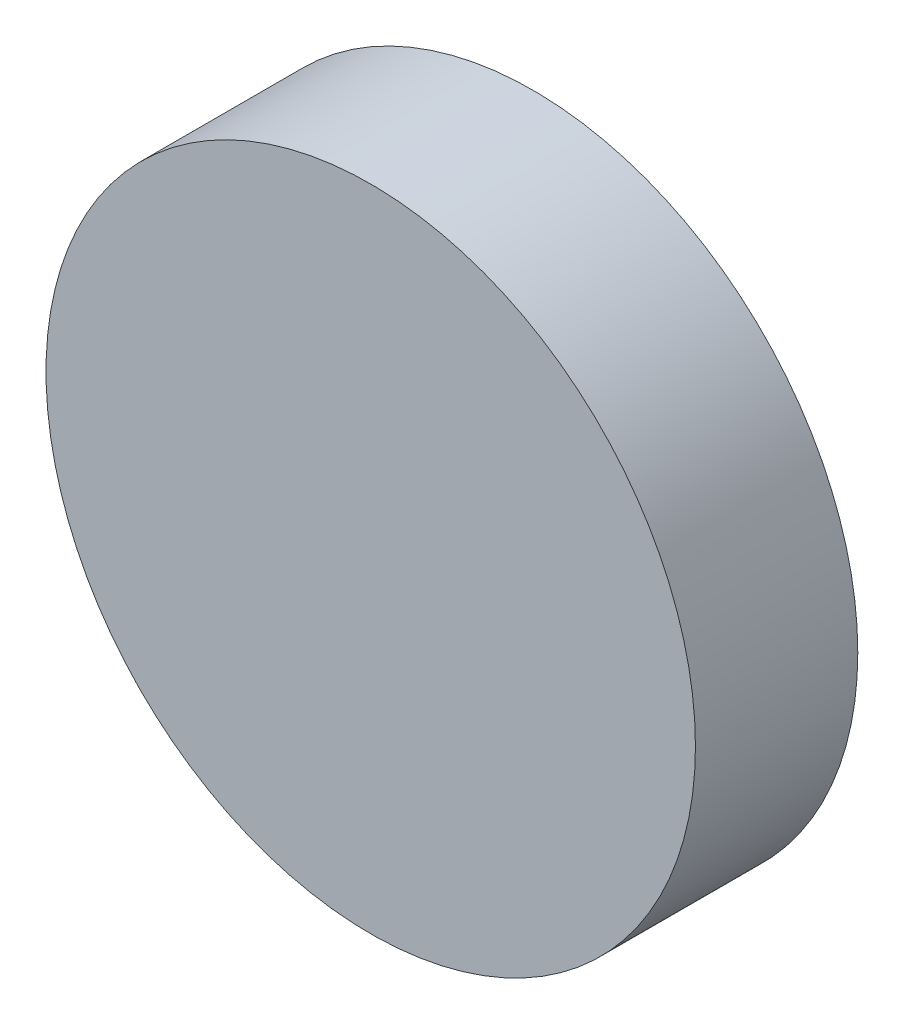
ISO-10303-21;
HEADER;
FILE_DESCRIPTION(('STEP AP214'),'2;1');
FILE_NAME('part.step','',(''),(''),'','','');
FILE_SCHEMA(('AUTOMOTIVE_DESIGN { 1 0 10303 214 1 1 1 1 }'));
ENDSEC;
DATA;
#1=APPLICATION_CONTEXT('core data for automotive mechanical design processes');
#2=APPLICATION_PROTOCOL_DEFINITION('international standard','automotive_design',2000,#1);
#3=PRODUCT_CONTEXT('',#1,'mechanical');
#4=PRODUCT('Part','Part','',(#3));
#5=PRODUCT_RELATED_PRODUCT_CATEGORY('part','',(#4));
#6=PRODUCT_DEFINITION_FORMATION('','',#4);
#7=PRODUCT_DEFINITION_CONTEXT('part definition',#1,'design');
#8=PRODUCT_DEFINITION('design','',#6,#7);
#9=PRODUCT_DEFINITION_SHAPE('','',#8);
#10=(LENGTH_UNIT() NAMED_UNIT(*) SI_UNIT(.MILLI.,.METRE.));
#11=(NAMED_UNIT(*) PLANE_ANGLE_UNIT() SI_UNIT($,.RADIAN.));
#12=(NAMED_UNIT(*) SI_UNIT($,.STERADIAN.) SOLID_ANGLE_UNIT());
#13=UNCERTAINTY_MEASURE_WITH_UNIT(LENGTH_MEASURE(1.E-05),#10,'distance_accuracy_value','');
#14=(GEOMETRIC_REPRESENTATION_CONTEXT(3) GLOBAL_UNCERTAINTY_ASSIGNED_CONTEXT((#13)) GLOBAL_UNIT_ASSIGNED_CONTEXT((#10,
#11,#12)) REPRESENTATION_CONTEXT('',''));
#15=CARTESIAN_POINT('',(0.,0.,0.));
#16=DIRECTION('',(0.,0.,1.));
#17=DIRECTION('',(1.,0.,0.));
#18=AXIS2_PLACEMENT_3D('',#15,#16,#17);
#19=CARTESIAN_POINT('',(0.,0.,30.));
#20=DIRECTION('',(0.,0.,-1.));
#21=DIRECTION('',(-1.,0.,0.));
#22=AXIS2_PLACEMENT_3D('',#19,#20,#21);
#23=CYLINDRICAL_SURFACE('',#22,60.);
#24=CARTESIAN_POINT('',(0.,0.,30.));
#25=DIRECTION('',(0.,0.,1.));
#26=DIRECTION('',(1.,0.,0.));
#27=AXIS2_PLACEMENT_3D('',#24,#25,#26);
#28=CIRCLE('',#27,60.);
#29=CARTESIAN_POINT('',(60.,0.,30.));
#30=VERTEX_POINT('',#29);
#31=EDGE_CURVE('E10',#30,#30,#28,.T.);
#32=ORIENTED_EDGE('',*,*,#31,.F.);
#33=EDGE_LOOP('',(#32));
#34=FACE_BOUND('',#33,.T.);
#35=CARTESIAN_POINT('',(0.,0.,0.));
#36=DIRECTION('',(0.,0.,1.));
#37=DIRECTION('',(1.,0.,0.));
#38=AXIS2_PLACEMENT_3D('',#35,#36,#37);
#39=CIRCLE('',#38,60.);
#40=CARTESIAN_POINT('',(60.,0.,0.));
#41=VERTEX_POINT('',#40);
#42=EDGE_CURVE('E34',#41,#41,#39,.T.);
#43=ORIENTED_EDGE('',*,*,#42,.T.);
#44=EDGE_LOOP('',(#43));
#45=FACE_BOUND('',#44,.T.);
#46=ADVANCED_FACE('F31',(#34,#45),#23,.T.);
#47=CARTESIAN_POINT('',(0.,0.,30.));
#48=DIRECTION('',(0.,0.,1.));
#49=DIRECTION('',(1.,0.,0.));
#50=AXIS2_PLACEMENT_3D('',#47,#48,#49);
#51=PLANE('',#50);
#52=ORIENTED_EDGE('',*,*,#31,.T.);
#53=EDGE_LOOP('',(#52));
#54=FACE_BOUND('',#53,.T.);
#55=ADVANCED_FACE('F46',(#54),#51,.T.);
#56=CARTESIAN_POINT('',(0.,0.,0.));
#57=DIRECTION('',(0.,0.,1.));
#58=DIRECTION('',(1.,0.,0.));
#59=AXIS2_PLACEMENT_3D('',#56,#57,#58);
#60=PLANE('',#59);
#61=ORIENTED_EDGE('',*,*,#42,.F.);
#62=EDGE_LOOP('',(#61));
#63=FACE_BOUND('',#62,.T.);
#64=ADVANCED_FACE('F44',(#63),#60,.F.);
#65=CLOSED_SHELL('',(#46,#55,#64));
#66=MANIFOLD_SOLID_BREP('B2',#65);
#67=ADVANCED_BREP_SHAPE_REPRESENTATION('',(#18,#66),#14);
#68=SHAPE_DEFINITION_REPRESENTATION(#9,#67);
ENDSEC;
END-ISO-10303-21;
